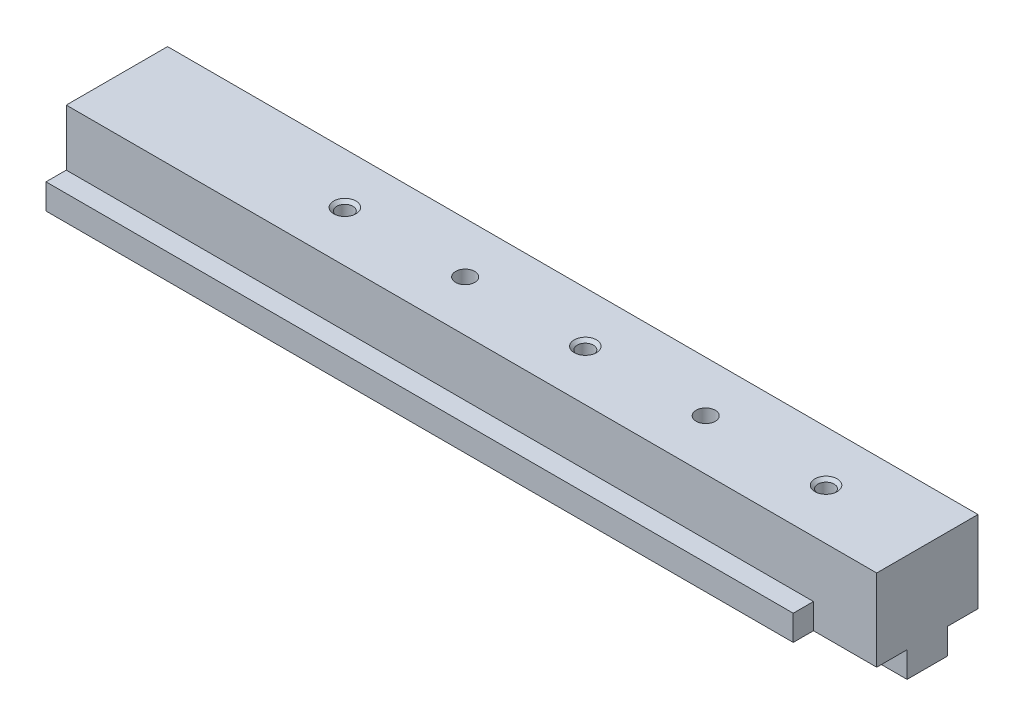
from build123d import *

# Parameters (mm, degrees)
EXTRUDE1_DEPTH     = 93.6752
EXTRUDE2_DEPTH     = 7.9248
SKETCH6_R          = 1.20269
CUT_EXTRUDE1_DEPTH = 3.048
SKETCH7_R          = 1.20269
CUT_EXTRUDE2_DEPTH = 3.048


with BuildPart() as part:
    # Sketch1 → Extrude1 (new body)
    with BuildSketch(Plane(origin=(0, 0, 0), x_dir=(0, 0, -1), z_dir=(1, 0, 0))):
        Polygon((-8.89, 3.2258), (-2.54, 3.2258), (-2.54, 0), (2.54, 0), (2.54, 3.2258), (8.89, 3.2258), (8.89, 6.4008), (6.35, 6.4008), (6.35, 13.462), (-6.35, 13.462), (-6.35, 6.4008), (-8.89, 6.4008), align=None)
    extrude(amount=EXTRUDE1_DEPTH)

    # Sketch2 → Extrude2 (add)
    with BuildSketch(Plane(origin=(93.6752, 0, 0), x_dir=(0, 0, -1), z_dir=(1, 0, 0))):
        Polygon((-6.35, 3.2258), (-2.54, 3.2258), (-2.54, 0), (2.54, 0), (2.54, 3.2258), (6.35, 3.2258), (6.35, 13.462), (-6.35, 13.462), align=None)
    extrude(amount=EXTRUDE2_DEPTH)

    # Sketch3 → Cut-Revolve1 (revolve, cut)
    with BuildSketch(Plane(origin=(88.9, 0, 0), x_dir=(0, 0, -1), z_dir=(1, 0, 0)), mode=Mode.PRIVATE) as cut_revolve1_sk:
        Polygon((0, 13.462), (1.397, 13.462), (1.016, 13.081), (1.016, 5.793587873), (0, 5.207), align=None)
    revolve(cut_revolve1_sk.sketch.rotate(Axis((88.9, 5.207, 0), (0, 1, 0)), 180), axis=Axis((88.9, 5.207, 0), (0, 1, 0)), mode=Mode.SUBTRACT)

    # Sketch4 → Cut-Revolve2 (revolve, cut)
    with BuildSketch(Plane(origin=(58.7248, 0, 0), x_dir=(0, 0, -1), z_dir=(1, 0, 0)), mode=Mode.PRIVATE) as cut_revolve2_sk:
        Polygon((0, 13.462), (1.397, 13.462), (1.016, 13.081), (1.016, 5.793587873), (0, 5.207), align=None)
    revolve(cut_revolve2_sk.sketch.rotate(Axis((58.7248, 5.207, 0), (0, 1, 0)), 180), axis=Axis((58.7248, 5.207, 0), (0, 1, 0)), mode=Mode.SUBTRACT)

    # Sketch5 → Cut-Revolve3 (revolve, cut)
    with BuildSketch(Plane(origin=(28.575, 0, 0), x_dir=(0, 0, -1), z_dir=(1, 0, 0)), mode=Mode.PRIVATE) as cut_revolve3_sk:
        Polygon((0, 13.462), (1.397, 13.462), (1.016, 13.081), (1.016, 5.793587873), (0, 5.207), align=None)
    revolve(cut_revolve3_sk.sketch.rotate(Axis((28.575, 5.207, 0), (0, 1, 0)), 180), axis=Axis((28.575, 5.207, 0), (0, 1, 0)), mode=Mode.SUBTRACT)

    # Sketch6 → Cut-Extrude1 (cut)
    with BuildSketch(Plane(origin=(0, 13.462, 0), x_dir=(-1, 0, 0), z_dir=(0, 1, 0))):
        with Locations(Location((-73.8124, 0, 0), (0, 0, 90))):
            Circle(SKETCH6_R)
    extrude(amount=-CUT_EXTRUDE1_DEPTH, mode=Mode.SUBTRACT)

    # Sketch7 → Cut-Extrude2 (cut)
    with BuildSketch(Plane(origin=(0, 13.462, 0), x_dir=(-1, 0, 0), z_dir=(0, 1, 0))):
        with Locations(Location((-43.6626, 0, 0), (0, 0, 90))):
            Circle(SKETCH7_R)
    extrude(amount=-CUT_EXTRUDE2_DEPTH, mode=Mode.SUBTRACT)


solid = part.part
